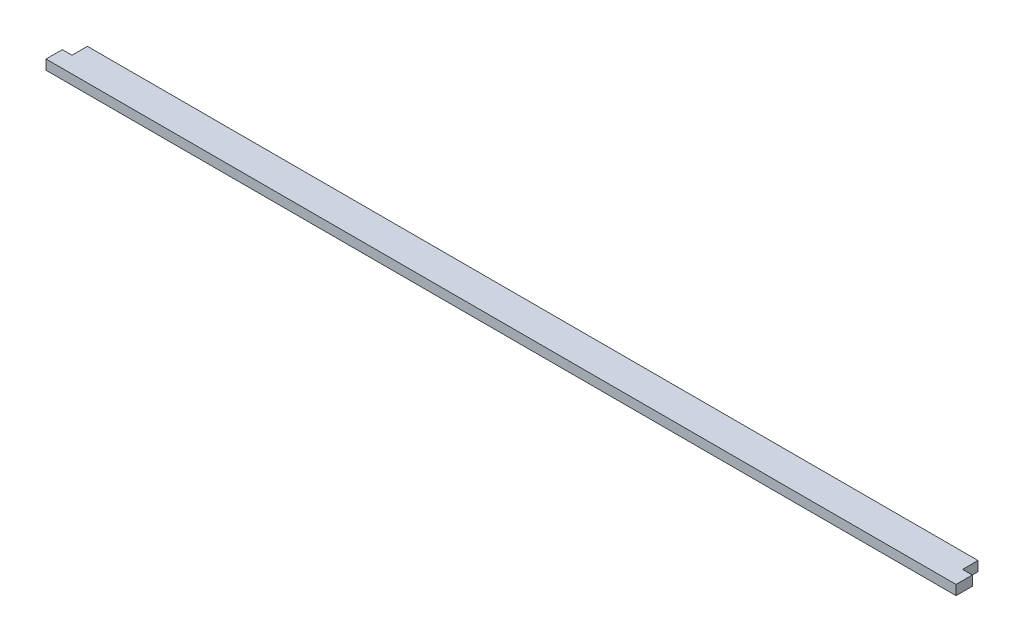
ISO-10303-21;
HEADER;
FILE_DESCRIPTION(('STEP AP214'),'2;1');
FILE_NAME('part.step','',(''),(''),'','','');
FILE_SCHEMA(('AUTOMOTIVE_DESIGN { 1 0 10303 214 1 1 1 1 }'));
ENDSEC;
DATA;
#1=APPLICATION_CONTEXT('core data for automotive mechanical design processes');
#2=APPLICATION_PROTOCOL_DEFINITION('international standard','automotive_design',2000,#1);
#3=PRODUCT_CONTEXT('',#1,'mechanical');
#4=PRODUCT('Part','Part','',(#3));
#5=PRODUCT_RELATED_PRODUCT_CATEGORY('part','',(#4));
#6=PRODUCT_DEFINITION_FORMATION('','',#4);
#7=PRODUCT_DEFINITION_CONTEXT('part definition',#1,'design');
#8=PRODUCT_DEFINITION('design','',#6,#7);
#9=PRODUCT_DEFINITION_SHAPE('','',#8);
#10=(LENGTH_UNIT() NAMED_UNIT(*) SI_UNIT(.MILLI.,.METRE.));
#11=(NAMED_UNIT(*) PLANE_ANGLE_UNIT() SI_UNIT($,.RADIAN.));
#12=(NAMED_UNIT(*) SI_UNIT($,.STERADIAN.) SOLID_ANGLE_UNIT());
#13=UNCERTAINTY_MEASURE_WITH_UNIT(LENGTH_MEASURE(1.E-05),#10,'distance_accuracy_value','');
#14=(GEOMETRIC_REPRESENTATION_CONTEXT(3) GLOBAL_UNCERTAINTY_ASSIGNED_CONTEXT((#13)) GLOBAL_UNIT_ASSIGNED_CONTEXT((#10,
#11,#12)) REPRESENTATION_CONTEXT('',''));
#15=CARTESIAN_POINT('',(0.,0.,0.));
#16=DIRECTION('',(0.,0.,1.));
#17=DIRECTION('',(1.,0.,0.));
#18=AXIS2_PLACEMENT_3D('',#15,#16,#17);
#19=CARTESIAN_POINT('',(548.,12.,-30.0000000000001));
#20=DIRECTION('',(-1.,0.,0.));
#21=DIRECTION('',(0.,0.,1.));
#22=AXIS2_PLACEMENT_3D('',#19,#20,#21);
#23=PLANE('',#22);
#24=DIRECTION('',(0.,-1.,0.));
#25=VECTOR('',#24,1.);
#26=CARTESIAN_POINT('',(548.,12.,-49.0000000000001));
#27=LINE('',#26,#25);
#28=CARTESIAN_POINT('',(548.,12.,-49.0000000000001));
#29=VERTEX_POINT('',#28);
#30=CARTESIAN_POINT('',(548.,0.,-49.0000000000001));
#31=VERTEX_POINT('',#30);
#32=EDGE_CURVE('E60',#29,#31,#27,.T.);
#33=ORIENTED_EDGE('',*,*,#32,.F.);
#34=DIRECTION('',(0.,0.,-1.));
#35=VECTOR('',#34,1.);
#36=CARTESIAN_POINT('',(548.,12.,-30.0000000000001));
#37=LINE('',#36,#35);
#38=CARTESIAN_POINT('',(548.,12.,-30.0000000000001));
#39=VERTEX_POINT('',#38);
#40=EDGE_CURVE('E168',#39,#29,#37,.T.);
#41=ORIENTED_EDGE('',*,*,#40,.F.);
#42=DIRECTION('',(0.,-1.,0.));
#43=VECTOR('',#42,1.);
#44=CARTESIAN_POINT('',(548.,12.,-30.0000000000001));
#45=LINE('',#44,#43);
#46=CARTESIAN_POINT('',(548.,0.,-30.0000000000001));
#47=VERTEX_POINT('',#46);
#48=EDGE_CURVE('E142',#39,#47,#45,.T.);
#49=ORIENTED_EDGE('',*,*,#48,.T.);
#50=DIRECTION('',(0.,0.,-1.));
#51=VECTOR('',#50,1.);
#52=CARTESIAN_POINT('',(548.,0.,-30.0000000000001));
#53=LINE('',#52,#51);
#54=EDGE_CURVE('E146',#47,#31,#53,.T.);
#55=ORIENTED_EDGE('',*,*,#54,.T.);
#56=EDGE_LOOP('',(#33,#41,#49,#55));
#57=FACE_BOUND('',#56,.T.);
#58=ADVANCED_FACE('F45',(#57),#23,.F.);
#59=CARTESIAN_POINT('',(-548.,12.,-30.0000000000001));
#60=DIRECTION('',(1.,0.,0.));
#61=DIRECTION('',(0.,0.,-1.));
#62=AXIS2_PLACEMENT_3D('',#59,#60,#61);
#63=PLANE('',#62);
#64=DIRECTION('',(0.,-1.,0.));
#65=VECTOR('',#64,1.);
#66=CARTESIAN_POINT('',(-548.,12.,-49.0000000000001));
#67=LINE('',#66,#65);
#68=CARTESIAN_POINT('',(-548.,12.,-49.0000000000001));
#69=VERTEX_POINT('',#68);
#70=CARTESIAN_POINT('',(-548.,0.,-49.0000000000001));
#71=VERTEX_POINT('',#70);
#72=EDGE_CURVE('E151',#69,#71,#67,.T.);
#73=ORIENTED_EDGE('',*,*,#72,.T.);
#74=DIRECTION('',(0.,0.,1.));
#75=VECTOR('',#74,1.);
#76=CARTESIAN_POINT('',(-548.,0.,-30.0000000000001));
#77=LINE('',#76,#75);
#78=CARTESIAN_POINT('',(-548.,0.,-30.0000000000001));
#79=VERTEX_POINT('',#78);
#80=EDGE_CURVE('E150',#71,#79,#77,.T.);
#81=ORIENTED_EDGE('',*,*,#80,.T.);
#82=DIRECTION('',(0.,-1.,0.));
#83=VECTOR('',#82,1.);
#84=CARTESIAN_POINT('',(-548.,12.,-30.0000000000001));
#85=LINE('',#84,#83);
#86=CARTESIAN_POINT('',(-548.,12.,-30.0000000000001));
#87=VERTEX_POINT('',#86);
#88=EDGE_CURVE('E11',#87,#79,#85,.T.);
#89=ORIENTED_EDGE('',*,*,#88,.F.);
#90=DIRECTION('',(0.,0.,1.));
#91=VECTOR('',#90,1.);
#92=CARTESIAN_POINT('',(-548.,12.,-30.0000000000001));
#93=LINE('',#92,#91);
#94=EDGE_CURVE('E104',#69,#87,#93,.T.);
#95=ORIENTED_EDGE('',*,*,#94,.F.);
#96=EDGE_LOOP('',(#73,#81,#89,#95));
#97=FACE_BOUND('',#96,.T.);
#98=ADVANCED_FACE('F203',(#97),#63,.F.);
#99=CARTESIAN_POINT('',(0.,12.,0.));
#100=DIRECTION('',(0.,-1.,0.));
#101=DIRECTION('',(0.,0.,-1.));
#102=AXIS2_PLACEMENT_3D('',#99,#100,#101);
#103=PLANE('',#102);
#104=DIRECTION('',(1.,0.,0.));
#105=VECTOR('',#104,1.);
#106=CARTESIAN_POINT('',(-548.,12.,-49.0000000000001));
#107=LINE('',#106,#105);
#108=EDGE_CURVE('E208',#69,#29,#107,.T.);
#109=ORIENTED_EDGE('',*,*,#108,.F.);
#110=ORIENTED_EDGE('',*,*,#94,.T.);
#111=DIRECTION('',(-1.,0.,0.));
#112=VECTOR('',#111,1.);
#113=CARTESIAN_POINT('',(-548.,12.,-30.0000000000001));
#114=LINE('',#113,#112);
#115=CARTESIAN_POINT('',(-560.,12.,-30.0000000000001));
#116=VERTEX_POINT('',#115);
#117=EDGE_CURVE('E193',#87,#116,#114,.T.);
#118=ORIENTED_EDGE('',*,*,#117,.T.);
#119=DIRECTION('',(0.,0.,1.));
#120=VECTOR('',#119,1.);
#121=CARTESIAN_POINT('',(-560.,12.,-10.0000000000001));
#122=LINE('',#121,#120);
#123=CARTESIAN_POINT('',(-560.,12.,-10.0000000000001));
#124=VERTEX_POINT('',#123);
#125=EDGE_CURVE('E122',#116,#124,#122,.T.);
#126=ORIENTED_EDGE('',*,*,#125,.T.);
#127=DIRECTION('',(1.,0.,0.));
#128=VECTOR('',#127,1.);
#129=CARTESIAN_POINT('',(-548.,12.,-10.0000000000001));
#130=LINE('',#129,#128);
#131=CARTESIAN_POINT('',(560.,12.,-10.0000000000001));
#132=VERTEX_POINT('',#131);
#133=EDGE_CURVE('E115',#124,#132,#130,.T.);
#134=ORIENTED_EDGE('',*,*,#133,.T.);
#135=DIRECTION('',(0.,0.,-1.));
#136=VECTOR('',#135,1.);
#137=CARTESIAN_POINT('',(560.,12.,-10.0000000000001));
#138=LINE('',#137,#136);
#139=CARTESIAN_POINT('',(560.,12.,-30.0000000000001));
#140=VERTEX_POINT('',#139);
#141=EDGE_CURVE('E119',#132,#140,#138,.T.);
#142=ORIENTED_EDGE('',*,*,#141,.T.);
#143=DIRECTION('',(-1.,0.,0.));
#144=VECTOR('',#143,1.);
#145=CARTESIAN_POINT('',(548.,12.,-30.0000000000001));
#146=LINE('',#145,#144);
#147=EDGE_CURVE('E69',#140,#39,#146,.T.);
#148=ORIENTED_EDGE('',*,*,#147,.T.);
#149=ORIENTED_EDGE('',*,*,#40,.T.);
#150=EDGE_LOOP('',(#109,#110,#118,#126,#134,#142,#148,#149));
#151=FACE_BOUND('',#150,.T.);
#152=ADVANCED_FACE('F117',(#151),#103,.F.);
#153=CARTESIAN_POINT('',(0.,0.,0.));
#154=DIRECTION('',(0.,-1.,0.));
#155=DIRECTION('',(0.,0.,-1.));
#156=AXIS2_PLACEMENT_3D('',#153,#154,#155);
#157=PLANE('',#156);
#158=ORIENTED_EDGE('',*,*,#80,.F.);
#159=DIRECTION('',(1.,0.,0.));
#160=VECTOR('',#159,1.);
#161=CARTESIAN_POINT('',(-548.,0.,-49.0000000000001));
#162=LINE('',#161,#160);
#163=EDGE_CURVE('E206',#71,#31,#162,.T.);
#164=ORIENTED_EDGE('',*,*,#163,.T.);
#165=ORIENTED_EDGE('',*,*,#54,.F.);
#166=DIRECTION('',(-1.,0.,0.));
#167=VECTOR('',#166,1.);
#168=CARTESIAN_POINT('',(548.,0.,-30.0000000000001));
#169=LINE('',#168,#167);
#170=CARTESIAN_POINT('',(560.,0.,-30.0000000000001));
#171=VERTEX_POINT('',#170);
#172=EDGE_CURVE('E96',#171,#47,#169,.T.);
#173=ORIENTED_EDGE('',*,*,#172,.F.);
#174=DIRECTION('',(0.,0.,-1.));
#175=VECTOR('',#174,1.);
#176=CARTESIAN_POINT('',(560.,0.,-10.0000000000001));
#177=LINE('',#176,#175);
#178=CARTESIAN_POINT('',(560.,0.,-10.0000000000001));
#179=VERTEX_POINT('',#178);
#180=EDGE_CURVE('E163',#179,#171,#177,.T.);
#181=ORIENTED_EDGE('',*,*,#180,.F.);
#182=DIRECTION('',(1.,0.,0.));
#183=VECTOR('',#182,1.);
#184=CARTESIAN_POINT('',(548.,0.,-10.0000000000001));
#185=LINE('',#184,#183);
#186=CARTESIAN_POINT('',(-560.,0.,-10.0000000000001));
#187=VERTEX_POINT('',#186);
#188=EDGE_CURVE('E131',#187,#179,#185,.T.);
#189=ORIENTED_EDGE('',*,*,#188,.F.);
#190=DIRECTION('',(0.,0.,1.));
#191=VECTOR('',#190,1.);
#192=CARTESIAN_POINT('',(-560.,0.,-10.0000000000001));
#193=LINE('',#192,#191);
#194=CARTESIAN_POINT('',(-560.,0.,-30.0000000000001));
#195=VERTEX_POINT('',#194);
#196=EDGE_CURVE('E157',#195,#187,#193,.T.);
#197=ORIENTED_EDGE('',*,*,#196,.F.);
#198=DIRECTION('',(-1.,0.,0.));
#199=VECTOR('',#198,1.);
#200=CARTESIAN_POINT('',(-548.,0.,-30.0000000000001));
#201=LINE('',#200,#199);
#202=EDGE_CURVE('E154',#79,#195,#201,.T.);
#203=ORIENTED_EDGE('',*,*,#202,.F.);
#204=EDGE_LOOP('',(#158,#164,#165,#173,#181,#189,#197,#203));
#205=FACE_BOUND('',#204,.T.);
#206=ADVANCED_FACE('F185',(#205),#157,.T.);
#207=CARTESIAN_POINT('',(-548.,12.,-30.0000000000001));
#208=DIRECTION('',(0.,0.,1.));
#209=DIRECTION('',(1.,0.,0.));
#210=AXIS2_PLACEMENT_3D('',#207,#208,#209);
#211=PLANE('',#210);
#212=ORIENTED_EDGE('',*,*,#202,.T.);
#213=DIRECTION('',(0.,-1.,0.));
#214=VECTOR('',#213,1.);
#215=CARTESIAN_POINT('',(-560.,12.,-30.0000000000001));
#216=LINE('',#215,#214);
#217=EDGE_CURVE('E53',#116,#195,#216,.T.);
#218=ORIENTED_EDGE('',*,*,#217,.F.);
#219=ORIENTED_EDGE('',*,*,#117,.F.);
#220=ORIENTED_EDGE('',*,*,#88,.T.);
#221=EDGE_LOOP('',(#212,#218,#219,#220));
#222=FACE_BOUND('',#221,.T.);
#223=ADVANCED_FACE('F200',(#222),#211,.F.);
#224=CARTESIAN_POINT('',(-560.,12.,-10.0000000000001));
#225=DIRECTION('',(1.,0.,0.));
#226=DIRECTION('',(0.,0.,-1.));
#227=AXIS2_PLACEMENT_3D('',#224,#225,#226);
#228=PLANE('',#227);
#229=ORIENTED_EDGE('',*,*,#196,.T.);
#230=DIRECTION('',(0.,-1.,0.));
#231=VECTOR('',#230,1.);
#232=CARTESIAN_POINT('',(-560.,12.,-10.0000000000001));
#233=LINE('',#232,#231);
#234=EDGE_CURVE('E135',#124,#187,#233,.T.);
#235=ORIENTED_EDGE('',*,*,#234,.F.);
#236=ORIENTED_EDGE('',*,*,#125,.F.);
#237=ORIENTED_EDGE('',*,*,#217,.T.);
#238=EDGE_LOOP('',(#229,#235,#236,#237));
#239=FACE_BOUND('',#238,.T.);
#240=ADVANCED_FACE('F179',(#239),#228,.F.);
#241=CARTESIAN_POINT('',(548.,12.,-10.0000000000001));
#242=DIRECTION('',(0.,0.,-1.));
#243=DIRECTION('',(-1.,0.,0.));
#244=AXIS2_PLACEMENT_3D('',#241,#242,#243);
#245=PLANE('',#244);
#246=ORIENTED_EDGE('',*,*,#188,.T.);
#247=DIRECTION('',(0.,-1.,0.));
#248=VECTOR('',#247,1.);
#249=CARTESIAN_POINT('',(560.,12.,-10.0000000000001));
#250=LINE('',#249,#248);
#251=EDGE_CURVE('E129',#132,#179,#250,.T.);
#252=ORIENTED_EDGE('',*,*,#251,.F.);
#253=ORIENTED_EDGE('',*,*,#133,.F.);
#254=ORIENTED_EDGE('',*,*,#234,.T.);
#255=EDGE_LOOP('',(#246,#252,#253,#254));
#256=FACE_BOUND('',#255,.T.);
#257=ADVANCED_FACE('F130',(#256),#245,.F.);
#258=CARTESIAN_POINT('',(560.,12.,-10.0000000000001));
#259=DIRECTION('',(-1.,0.,0.));
#260=DIRECTION('',(0.,0.,1.));
#261=AXIS2_PLACEMENT_3D('',#258,#259,#260);
#262=PLANE('',#261);
#263=ORIENTED_EDGE('',*,*,#180,.T.);
#264=DIRECTION('',(0.,-1.,0.));
#265=VECTOR('',#264,1.);
#266=CARTESIAN_POINT('',(560.,12.,-30.0000000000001));
#267=LINE('',#266,#265);
#268=EDGE_CURVE('E136',#140,#171,#267,.T.);
#269=ORIENTED_EDGE('',*,*,#268,.F.);
#270=ORIENTED_EDGE('',*,*,#141,.F.);
#271=ORIENTED_EDGE('',*,*,#251,.T.);
#272=EDGE_LOOP('',(#263,#269,#270,#271));
#273=FACE_BOUND('',#272,.T.);
#274=ADVANCED_FACE('F138',(#273),#262,.F.);
#275=CARTESIAN_POINT('',(548.,12.,-30.0000000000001));
#276=DIRECTION('',(0.,0.,1.));
#277=DIRECTION('',(1.,0.,0.));
#278=AXIS2_PLACEMENT_3D('',#275,#276,#277);
#279=PLANE('',#278);
#280=ORIENTED_EDGE('',*,*,#172,.T.);
#281=ORIENTED_EDGE('',*,*,#48,.F.);
#282=ORIENTED_EDGE('',*,*,#147,.F.);
#283=ORIENTED_EDGE('',*,*,#268,.T.);
#284=EDGE_LOOP('',(#280,#281,#282,#283));
#285=FACE_BOUND('',#284,.T.);
#286=ADVANCED_FACE('F187',(#285),#279,.F.);
#287=CARTESIAN_POINT('',(-548.,12.,-49.0000000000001));
#288=DIRECTION('',(0.,0.,-1.));
#289=DIRECTION('',(-1.,0.,0.));
#290=AXIS2_PLACEMENT_3D('',#287,#288,#289);
#291=PLANE('',#290);
#292=ORIENTED_EDGE('',*,*,#163,.F.);
#293=ORIENTED_EDGE('',*,*,#72,.F.);
#294=ORIENTED_EDGE('',*,*,#108,.T.);
#295=ORIENTED_EDGE('',*,*,#32,.T.);
#296=EDGE_LOOP('',(#292,#293,#294,#295));
#297=FACE_BOUND('',#296,.T.);
#298=ADVANCED_FACE('F209',(#297),#291,.T.);
#299=CLOSED_SHELL('',(#58,#98,#152,#206,#223,#240,#257,#274,#286,#298));
#300=MANIFOLD_SOLID_BREP('B2',#299);
#301=ADVANCED_BREP_SHAPE_REPRESENTATION('',(#18,#300),#14);
#302=SHAPE_DEFINITION_REPRESENTATION(#9,#301);
ENDSEC;
END-ISO-10303-21;
